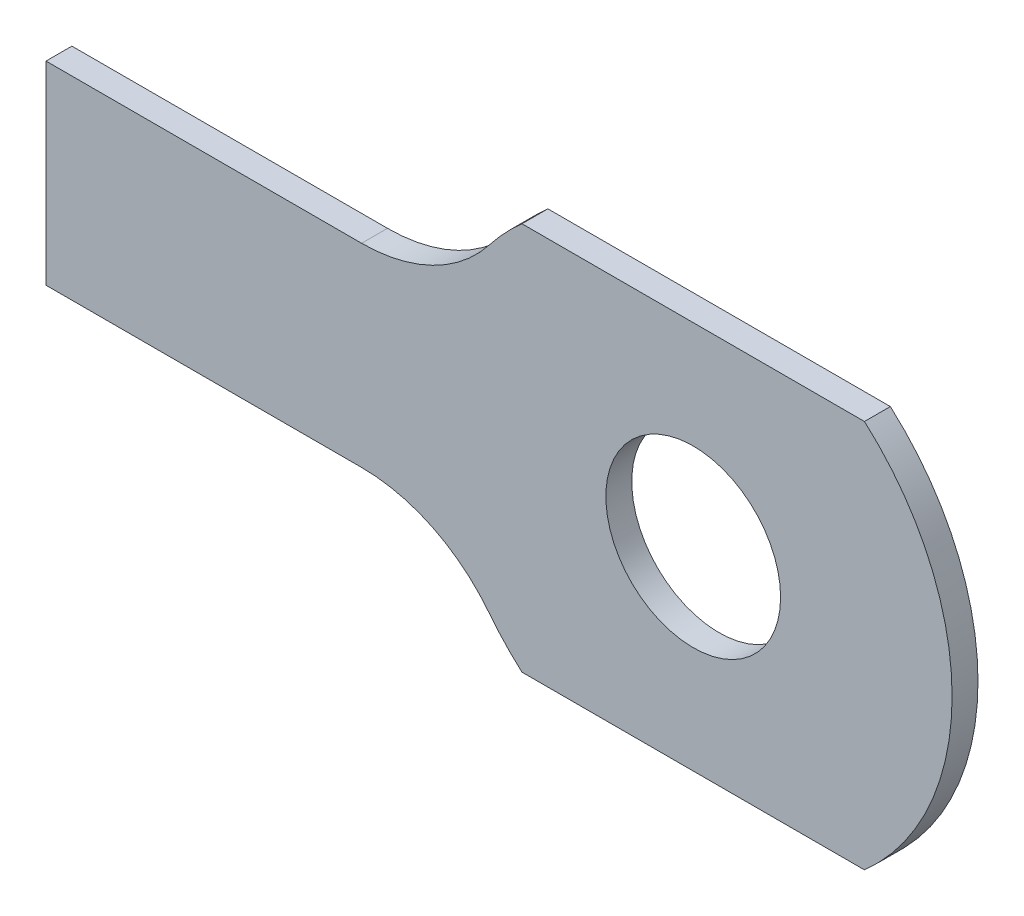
from build123d import *

# Parameters (mm, degrees)
SKETCH1_R          = 1.35
BASE_EXTRUDE_DEPTH = 0.4


with BuildPart() as part:
    # Sketch1 → Base-Extrude (new body)
    with BuildSketch(Plane.XY):
        with BuildLine():
            Line((-2.645751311, 3), (2.645751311, 3))
            ThreePointArc((2.645751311, 3), (4, 0), (2.645751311, -3))
            Line((2.645751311, -3), (-2.645751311, -3))
            ThreePointArc((-2.645751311, -3), (-2.911803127, -2.742517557), (-3.152907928, -2.461538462))
            ThreePointArc((-3.152907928, -2.461538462), (-4.027152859, -1.753207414), (-5.123475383, -1.5))
            Line((-5.123475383, -1.5), (-10, -1.5))
            Line((-10, -1.5), (-10, 1.5))
            Line((-10, 1.5), (-5.123475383, 1.5))
            ThreePointArc((-5.123475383, 1.5), (-4.027152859, 1.753207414), (-3.152907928, 2.461538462))
            ThreePointArc((-3.152907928, 2.461538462), (-2.911803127, 2.742517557), (-2.645751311, 3))
        make_face()
        Circle(SKETCH1_R, mode=Mode.SUBTRACT)
    extrude(amount=-BASE_EXTRUDE_DEPTH)


solid = part.part
